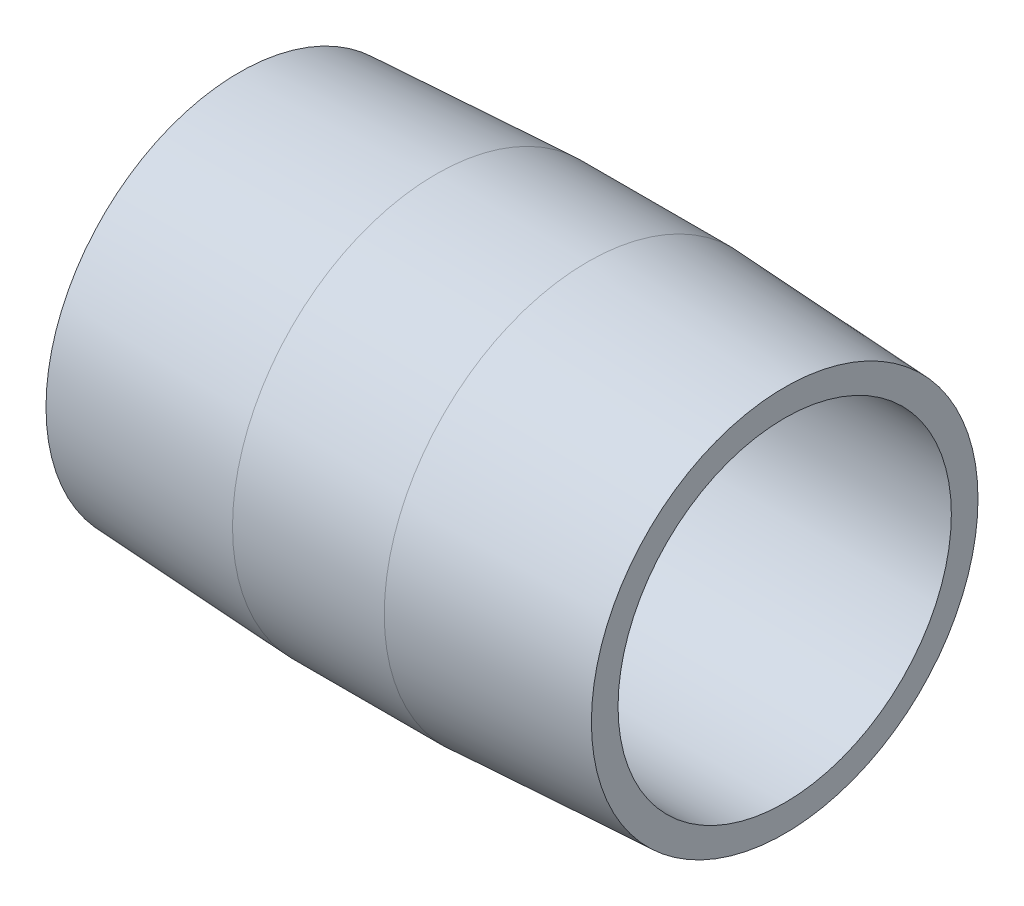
from build123d import *


with BuildPart() as part:
    # Sketch1 → Revolve1 (revolve)
    with BuildSketch(Plane.XY, mode=Mode.PRIVATE) as revolve1_sk:
        Polygon((28.575, 8.73125), (0, 8.73125), (0, 10.127550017), (10.3124, 10.668), (18.2626, 10.668), (28.575, 10.127550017), align=None)
    revolve(revolve1_sk.sketch.rotate(Axis((0, 0, 0), (1, 0, 0)), 90), axis=Axis((0, 0, 0), (1, 0, 0)))


solid = part.part
